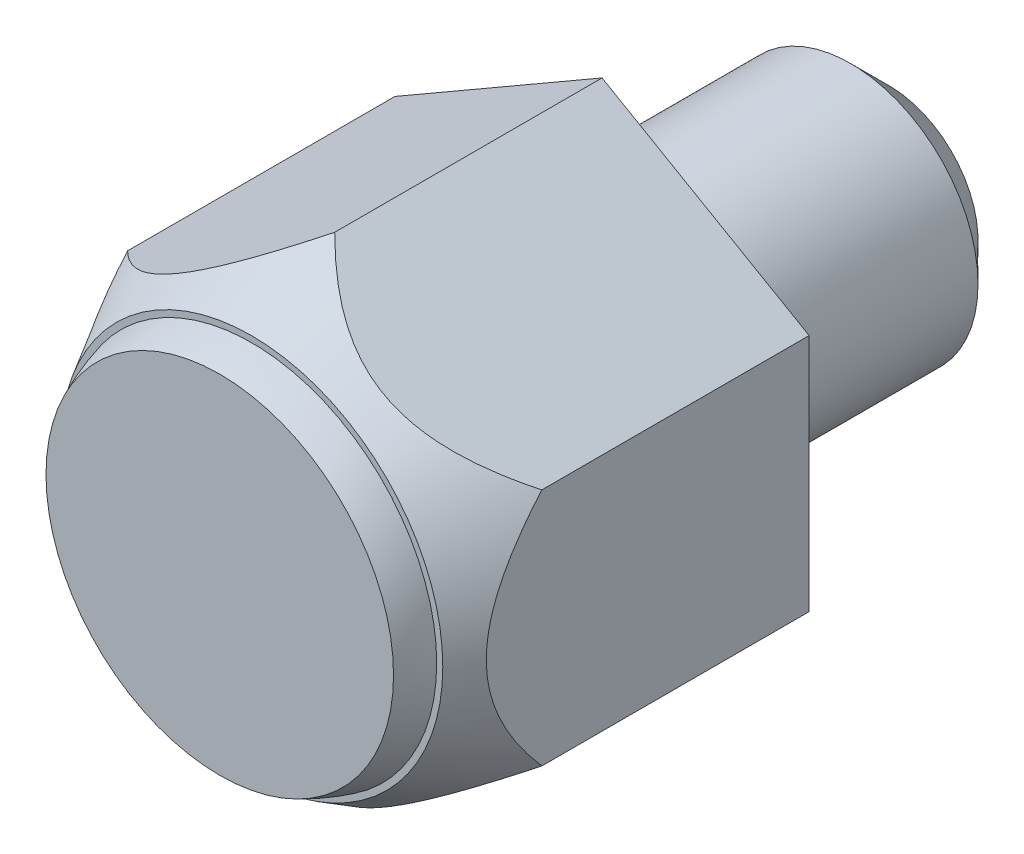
ISO-10303-21;
HEADER;
FILE_DESCRIPTION(('STEP AP214'),'2;1');
FILE_NAME('part.step','',(''),(''),'','','');
FILE_SCHEMA(('AUTOMOTIVE_DESIGN { 1 0 10303 214 1 1 1 1 }'));
ENDSEC;
DATA;
#1=APPLICATION_CONTEXT('core data for automotive mechanical design processes');
#2=APPLICATION_PROTOCOL_DEFINITION('international standard','automotive_design',2000,#1);
#3=PRODUCT_CONTEXT('',#1,'mechanical');
#4=PRODUCT('Part','Part','',(#3));
#5=PRODUCT_RELATED_PRODUCT_CATEGORY('part','',(#4));
#6=PRODUCT_DEFINITION_FORMATION('','',#4);
#7=PRODUCT_DEFINITION_CONTEXT('part definition',#1,'design');
#8=PRODUCT_DEFINITION('design','',#6,#7);
#9=PRODUCT_DEFINITION_SHAPE('','',#8);
#10=(LENGTH_UNIT() NAMED_UNIT(*) SI_UNIT(.MILLI.,.METRE.));
#11=(NAMED_UNIT(*) PLANE_ANGLE_UNIT() SI_UNIT($,.RADIAN.));
#12=(NAMED_UNIT(*) SI_UNIT($,.STERADIAN.) SOLID_ANGLE_UNIT());
#13=UNCERTAINTY_MEASURE_WITH_UNIT(LENGTH_MEASURE(1.E-05),#10,'distance_accuracy_value','');
#14=(GEOMETRIC_REPRESENTATION_CONTEXT(3) GLOBAL_UNCERTAINTY_ASSIGNED_CONTEXT((#13)) GLOBAL_UNIT_ASSIGNED_CONTEXT((#10,
#11,#12)) REPRESENTATION_CONTEXT('',''));
#15=CARTESIAN_POINT('',(0.,0.,0.));
#16=DIRECTION('',(0.,0.,1.));
#17=DIRECTION('',(1.,0.,0.));
#18=AXIS2_PLACEMENT_3D('',#15,#16,#17);
#19=CARTESIAN_POINT('',(0.,0.,12.));
#20=DIRECTION('',(0.,0.,1.));
#21=DIRECTION('',(1.,0.,0.));
#22=AXIS2_PLACEMENT_3D('',#19,#20,#21);
#23=PLANE('',#22);
#24=CARTESIAN_POINT('',(0.,0.,12.));
#25=DIRECTION('',(0.,0.,1.));
#26=DIRECTION('',(1.,0.,0.));
#27=AXIS2_PLACEMENT_3D('',#24,#25,#26);
#28=CIRCLE('',#27,5.45435605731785);
#29=CARTESIAN_POINT('',(5.45435605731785,0.,12.));
#30=VERTEX_POINT('',#29);
#31=EDGE_CURVE('E112',#30,#30,#28,.T.);
#32=ORIENTED_EDGE('',*,*,#31,.T.);
#33=EDGE_LOOP('',(#32));
#34=FACE_BOUND('',#33,.T.);
#35=ADVANCED_FACE('F14',(#34),#23,.T.);
#36=CARTESIAN_POINT('',(0.,0.,9.5));
#37=DIRECTION('',(0.,0.,1.));
#38=DIRECTION('',(1.,0.,0.));
#39=AXIS2_PLACEMENT_3D('',#36,#37,#38);
#40=SPHERICAL_SURFACE('',#39,6.);
#41=CARTESIAN_POINT('',(0.,0.,11.));
#42=DIRECTION('',(0.,0.,1.));
#43=DIRECTION('',(1.,0.,0.));
#44=AXIS2_PLACEMENT_3D('',#41,#42,#43);
#45=CIRCLE('',#44,5.80947501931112);
#46=CARTESIAN_POINT('',(5.80947501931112,0.,11.));
#47=VERTEX_POINT('',#46);
#48=EDGE_CURVE('E109',#47,#47,#45,.T.);
#49=CARTESIAN_POINT('',(5.80947501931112,0.,11.));
#50=CARTESIAN_POINT('',(5.8067079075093,0.,11.010716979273));
#51=CARTESIAN_POINT('',(5.80391113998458,0.,11.021426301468));
#52=CARTESIAN_POINT('',(5.79825838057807,0.,11.0428293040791));
#53=CARTESIAN_POINT('',(5.79540238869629,0.,11.0535229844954));
#54=CARTESIAN_POINT('',(5.78963126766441,0.,11.0748943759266));
#55=CARTESIAN_POINT('',(5.78671613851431,0.,11.0855720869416));
#56=CARTESIAN_POINT('',(5.78082683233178,0.,11.1069112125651));
#57=CARTESIAN_POINT('',(5.77785265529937,0.,11.1175726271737));
#58=CARTESIAN_POINT('',(5.77184534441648,0.,11.1388788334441));
#59=CARTESIAN_POINT('',(5.76881221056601,0.,11.1495236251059));
#60=CARTESIAN_POINT('',(5.76268707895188,0.,11.1707962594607));
#61=CARTESIAN_POINT('',(5.75959508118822,0.,11.1814241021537));
#62=CARTESIAN_POINT('',(5.75335231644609,0.,11.2026625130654));
#63=CARTESIAN_POINT('',(5.75020154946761,0.,11.2132730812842));
#64=CARTESIAN_POINT('',(5.74384134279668,0.,11.2344766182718));
#65=CARTESIAN_POINT('',(5.74063190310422,0.,11.2450695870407));
#66=CARTESIAN_POINT('',(5.73415444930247,0.,11.2662376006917));
#67=CARTESIAN_POINT('',(5.7308864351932,0.,11.2768126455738));
#68=CARTESIAN_POINT('',(5.72429193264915,0.,11.2979444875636));
#69=CARTESIAN_POINT('',(5.72096544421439,0.,11.3085012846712));
#70=CARTESIAN_POINT('',(5.71425409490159,0.,11.3295963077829));
#71=CARTESIAN_POINT('',(5.71086923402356,0.,11.340134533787));
#72=CARTESIAN_POINT('',(5.70404124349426,0.,11.3611920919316));
#73=CARTESIAN_POINT('',(5.70059811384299,0.,11.3717114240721));
#74=CARTESIAN_POINT('',(5.69365369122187,0.,11.392730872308));
#75=CARTESIAN_POINT('',(5.69015239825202,0.,11.4032309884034));
#76=CARTESIAN_POINT('',(5.68309175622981,0.,11.4242116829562));
#77=CARTESIAN_POINT('',(5.67953240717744,0.,11.4346922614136));
#78=CARTESIAN_POINT('',(5.67235576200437,0.,11.4556335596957));
#79=CARTESIAN_POINT('',(5.66873846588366,0.,11.4660942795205));
#80=CARTESIAN_POINT('',(5.66144603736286,0.,11.4869955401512));
#81=CARTESIAN_POINT('',(5.65777090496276,0.,11.4974360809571));
#82=CARTESIAN_POINT('',(5.65036291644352,0.,11.5182966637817));
#83=CARTESIAN_POINT('',(5.64663006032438,0.,11.5287167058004));
#84=CARTESIAN_POINT('',(5.63910673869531,0.,11.5495359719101));
#85=CARTESIAN_POINT('',(5.63531627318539,0.,11.5599351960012));
#86=CARTESIAN_POINT('',(5.62767784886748,0.,11.5807125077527));
#87=CARTESIAN_POINT('',(5.6238298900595,0.,11.5910905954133));
#88=CARTESIAN_POINT('',(5.61607659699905,0.,11.6118253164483));
#89=CARTESIAN_POINT('',(5.61217126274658,0.,11.6221819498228));
#90=CARTESIAN_POINT('',(5.60430333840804,0.,11.6428734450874));
#91=CARTESIAN_POINT('',(5.60034074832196,0.,11.6532083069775));
#92=CARTESIAN_POINT('',(5.59235843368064,0.,11.6738559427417));
#93=CARTESIAN_POINT('',(5.58833870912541,0.,11.6841687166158));
#94=CARTESIAN_POINT('',(5.58024224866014,0.,11.7047718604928));
#95=CARTESIAN_POINT('',(5.57616551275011,0.,11.7150622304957));
#96=CARTESIAN_POINT('',(5.56795515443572,0.,11.7356202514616));
#97=CARTESIAN_POINT('',(5.56382153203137,0.,11.7458879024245));
#98=CARTESIAN_POINT('',(5.55549752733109,0.,11.7664001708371));
#99=CARTESIAN_POINT('',(5.55130714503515,0.,11.7766447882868));
#100=CARTESIAN_POINT('',(5.54286974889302,0.,11.7971106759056));
#101=CARTESIAN_POINT('',(5.53862273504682,0.,11.8073319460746));
#102=CARTESIAN_POINT('',(5.53007220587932,0.,11.8277508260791));
#103=CARTESIAN_POINT('',(5.52576869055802,0.,11.8379484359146));
#104=CARTESIAN_POINT('',(5.51710529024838,0.,11.858319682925));
#105=CARTESIAN_POINT('',(5.51274540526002,0.,11.8684933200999));
#106=CARTESIAN_POINT('',(5.50396939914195,0.,11.8888163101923));
#107=CARTESIAN_POINT('',(5.49955327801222,0.,11.8989656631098));
#108=CARTESIAN_POINT('',(5.49066493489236,0.,11.9192397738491));
#109=CARTESIAN_POINT('',(5.48619271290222,0.,11.929364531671));
#110=CARTESIAN_POINT('',(5.47719230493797,0.,11.9495891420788));
#111=CARTESIAN_POINT('',(5.47266411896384,0.,11.9596889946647));
#112=CARTESIAN_POINT('',(5.46355192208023,0.,11.97986348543));
#113=CARTESIAN_POINT('',(5.45896791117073,0.,11.9899381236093));
#114=CARTESIAN_POINT('',(5.45435605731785,0.,12.));
#115=B_SPLINE_CURVE_WITH_KNOTS('',3,(#49,#50,#51,#52,#53,#54,#55,#56,#57,#58,#59,#60,#61,#62,
#63,#64,#65,#66,#67,#68,#69,#70,#71,#72,#73,#74,#75,#76,#77,#78,#79,#80,#81,#82,#83,#84,#85,#86,
#87,#88,#89,#90,#91,#92,#93,#94,#95,#96,#97,#98,#99,#100,#101,#102,#103,#104,#105,#106,#107,
#108,#109,#110,#111,#112,#113,#114),.UNSPECIFIED.,.F.,.F.,(4,2,2,2,2,2,2,2,2,2,2,2,2,2,2,2,2,2,
2,2,2,2,2,2,2,2,2,2,2,2,2,2,4),(0.,0.0332053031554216,0.0664106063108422,0.0996159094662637,
0.132821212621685,0.166026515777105,0.199231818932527,0.232437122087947,0.265642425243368,
0.29884772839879,0.332053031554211,0.365258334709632,0.398463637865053,0.431668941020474,
0.464874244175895,0.498079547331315,0.531284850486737,0.564490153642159,0.597695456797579,
0.630900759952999,0.664106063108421,0.697311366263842,0.730516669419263,0.763721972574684,
0.796927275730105,0.830132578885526,0.863337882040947,0.896543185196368,0.92974848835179,
0.96295379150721,0.996159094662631,1.02936439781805,1.06256970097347),.UNSPECIFIED.);
#116=EDGE_CURVE('BSEAM183',#47,#30,#115,.T.);
#117=ORIENTED_EDGE('',*,*,#48,.T.);
#118=ORIENTED_EDGE('',*,*,#31,.F.);
#119=ORIENTED_EDGE('',*,*,#116,.T.);
#120=ORIENTED_EDGE('',*,*,#116,.F.);
#121=EDGE_LOOP('',(#117,#119,#118,#120));
#122=FACE_BOUND('',#121,.T.);
#123=ADVANCED_FACE('F183',(#122),#40,.T.);
#124=CARTESIAN_POINT('',(5.80947501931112,0.,11.));
#125=DIRECTION('',(0.,0.,1.));
#126=DIRECTION('',(1.,0.,0.));
#127=AXIS2_PLACEMENT_3D('',#124,#125,#126);
#128=PLANE('',#127);
#129=CARTESIAN_POINT('',(0.,0.,11.));
#130=DIRECTION('',(0.,0.,1.));
#131=DIRECTION('',(1.,0.,0.));
#132=AXIS2_PLACEMENT_3D('',#129,#130,#131);
#133=CIRCLE('',#132,6.);
#134=CARTESIAN_POINT('',(6.,0.,11.));
#135=VERTEX_POINT('',#134);
#136=EDGE_CURVE('E79',#135,#135,#133,.T.);
#137=ORIENTED_EDGE('',*,*,#136,.T.);
#138=EDGE_LOOP('',(#137));
#139=FACE_BOUND('',#138,.T.);
#140=ORIENTED_EDGE('',*,*,#48,.F.);
#141=EDGE_LOOP('',(#140));
#142=FACE_BOUND('',#141,.T.);
#143=ADVANCED_FACE('F142',(#139,#142),#128,.T.);
#144=CARTESIAN_POINT('',(0.,0.,11.));
#145=DIRECTION('',(0.,0.,-1.));
#146=DIRECTION('',(-1.,0.,0.));
#147=AXIS2_PLACEMENT_3D('',#144,#145,#146);
#148=CONICAL_SURFACE('',#147,6.,0.523598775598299);
#149=CARTESIAN_POINT('',(0.000200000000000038,-7.505668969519,8.39210484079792));
#150=CARTESIAN_POINT('',(-0.0677848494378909,-7.4664178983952,8.4600858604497));
#151=CARTESIAN_POINT('',(-0.136448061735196,-7.42677517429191,8.52716017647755));
#152=CARTESIAN_POINT('',(-0.275280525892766,-7.34662021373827,8.65924264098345));
#153=CARTESIAN_POINT('',(-0.345450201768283,-7.3061077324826,8.72425019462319));
#154=CARTESIAN_POINT('',(-0.559107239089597,-7.18275278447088,8.91638593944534));
#155=CARTESIAN_POINT('',(-0.705052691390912,-7.09849113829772,9.03992894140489));
#156=CARTESIAN_POINT('',(-1.00830495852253,-6.9234083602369,9.2774020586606));
#157=CARTESIAN_POINT('',(-1.16580788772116,-6.83247400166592,9.39100134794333));
#158=CARTESIAN_POINT('',(-1.48934600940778,-6.64567918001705,9.60009315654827));
#159=CARTESIAN_POINT('',(-1.65536127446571,-6.54983022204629,9.69562571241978));
#160=CARTESIAN_POINT('',(-1.9184841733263,-6.39791614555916,9.82470210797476));
#161=CARTESIAN_POINT('',(-2.01251169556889,-6.34362933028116,9.8666537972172));
#162=CARTESIAN_POINT('',(-2.20302936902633,-6.23363390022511,9.9424252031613));
#163=CARTESIAN_POINT('',(-2.29951970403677,-6.17792517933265,9.97624431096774));
#164=CARTESIAN_POINT('',(-2.4938115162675,-6.06575074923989,10.0344577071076));
#165=CARTESIAN_POINT('',(-2.59159656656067,-6.00929452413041,10.0589244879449));
#166=CARTESIAN_POINT('',(-2.7886382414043,-5.89553246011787,10.0979257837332));
#167=CARTESIAN_POINT('',(-2.88789458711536,-5.83822678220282,10.1124621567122));
#168=CARTESIAN_POINT('',(-3.0880691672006,-5.72265593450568,10.1311082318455));
#169=CARTESIAN_POINT('',(-3.18899428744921,-5.66438678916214,10.135120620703));
#170=CARTESIAN_POINT('',(-3.39072664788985,-5.54791655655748,10.1322640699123));
#171=CARTESIAN_POINT('',(-3.49153388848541,-5.48971546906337,10.1253951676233));
#172=CARTESIAN_POINT('',(-3.69239484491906,-5.37374834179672,10.1010445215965));
#173=CARTESIAN_POINT('',(-3.79244644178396,-5.31598352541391,10.0835396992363));
#174=CARTESIAN_POINT('',(-3.99090038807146,-5.20140608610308,10.0385918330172));
#175=CARTESIAN_POINT('',(-4.08930170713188,-5.14459405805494,10.0111428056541));
#176=CARTESIAN_POINT('',(-4.3119645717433,-5.01603959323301,9.93805151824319));
#177=CARTESIAN_POINT('',(-4.43549595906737,-4.94471871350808,9.88944510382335));
#178=CARTESIAN_POINT('',(-4.67830004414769,-4.80453570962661,9.77963478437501));
#179=CARTESIAN_POINT('',(-4.79757006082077,-4.73567513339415,9.71842310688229));
#180=CARTESIAN_POINT('',(-5.03214160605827,-4.60024518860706,9.58538765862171));
#181=CARTESIAN_POINT('',(-5.147425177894,-4.53368618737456,9.51352206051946));
#182=CARTESIAN_POINT('',(-5.37365566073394,-4.40307195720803,9.36133304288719));
#183=CARTESIAN_POINT('',(-5.48460328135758,-4.33901631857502,9.28101101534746));
#184=CARTESIAN_POINT('',(-5.75326201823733,-4.18390612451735,9.07450545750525));
#185=CARTESIAN_POINT('',(-5.90869904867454,-4.09416451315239,8.94437902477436));
#186=CARTESIAN_POINT('',(-6.13543606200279,-3.96325783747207,8.74180970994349));
#187=CARTESIAN_POINT('',(-6.20954407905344,-3.92047155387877,8.67346346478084));
#188=CARTESIAN_POINT('',(-6.35608489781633,-3.83586617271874,8.53444941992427));
#189=CARTESIAN_POINT('',(-6.42851804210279,-3.7940468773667,8.46378210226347));
#190=CARTESIAN_POINT('',(-6.5002,-3.75266127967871,8.39210484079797));
#191=B_SPLINE_CURVE_WITH_KNOTS('',3,(#149,#150,#151,#152,#153,#154,#155,#156,#157,#158,#159,
#160,#161,#162,#163,#164,#165,#166,#167,#168,#169,#170,#171,#172,#173,#174,#175,#176,#177,#178,
#179,#180,#181,#182,#183,#184,#185,#186,#187,#188,#189,#190),.UNSPECIFIED.,.F.,.F.,(4,2,2,2,2,2,
2,2,2,2,2,2,2,2,2,2,2,2,2,2,4),(0.,0.311524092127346,0.62313704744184,1.24953684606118,
1.89212041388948,2.53326286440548,2.8821886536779,3.23114055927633,3.57732997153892,
3.92345459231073,4.27276865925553,4.62208152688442,4.97215508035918,5.3224396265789,
5.77378885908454,6.2254172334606,6.67886811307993,7.13224446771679,7.79667734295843,
8.12519954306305,8.45365394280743),.UNSPECIFIED.);
#192=CARTESIAN_POINT('',(0.,-7.50555349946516,8.39230484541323));
#193=VERTEX_POINT('',#192);
#194=CARTESIAN_POINT('',(-6.5,-3.75277674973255,8.39230484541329));
#195=VERTEX_POINT('',#194);
#196=EDGE_CURVE('E170',#193,#195,#191,.T.);
#197=ORIENTED_EDGE('',*,*,#196,.F.);
#198=CARTESIAN_POINT('',(-0.000199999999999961,-7.505668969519,8.39210484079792));
#199=CARTESIAN_POINT('',(0.0677848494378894,-7.46641789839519,8.4600858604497));
#200=CARTESIAN_POINT('',(0.136448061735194,-7.42677517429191,8.52716017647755));
#201=CARTESIAN_POINT('',(0.275280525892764,-7.34662021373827,8.65924264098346));
#202=CARTESIAN_POINT('',(0.345450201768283,-7.30610773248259,8.7242501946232));
#203=CARTESIAN_POINT('',(0.5591072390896,-7.18275278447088,8.91638593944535));
#204=CARTESIAN_POINT('',(0.705052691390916,-7.09849113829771,9.0399289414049));
#205=CARTESIAN_POINT('',(1.00830495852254,-6.9234083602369,9.27740205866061));
#206=CARTESIAN_POINT('',(1.16580788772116,-6.83247400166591,9.39100134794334));
#207=CARTESIAN_POINT('',(1.48934600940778,-6.64567918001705,9.60009315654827));
#208=CARTESIAN_POINT('',(1.65536127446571,-6.54983022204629,9.69562571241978));
#209=CARTESIAN_POINT('',(1.9184841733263,-6.39791614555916,9.82470210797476));
#210=CARTESIAN_POINT('',(2.01251169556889,-6.34362933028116,9.8666537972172));
#211=CARTESIAN_POINT('',(2.20302936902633,-6.23363390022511,9.94242520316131));
#212=CARTESIAN_POINT('',(2.29951970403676,-6.17792517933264,9.97624431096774));
#213=CARTESIAN_POINT('',(2.49381151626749,-6.06575074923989,10.0344577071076));
#214=CARTESIAN_POINT('',(2.59159656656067,-6.0092945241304,10.0589244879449));
#215=CARTESIAN_POINT('',(2.7886382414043,-5.89553246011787,10.0979257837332));
#216=CARTESIAN_POINT('',(2.88789458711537,-5.83822678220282,10.1124621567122));
#217=CARTESIAN_POINT('',(3.08806916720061,-5.72265593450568,10.1311082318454));
#218=CARTESIAN_POINT('',(3.18899428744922,-5.66438678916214,10.135120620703));
#219=CARTESIAN_POINT('',(3.39072664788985,-5.54791655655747,10.1322640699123));
#220=CARTESIAN_POINT('',(3.49153388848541,-5.48971546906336,10.1253951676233));
#221=CARTESIAN_POINT('',(3.69239484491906,-5.37374834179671,10.1010445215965));
#222=CARTESIAN_POINT('',(3.79244644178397,-5.3159835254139,10.0835396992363));
#223=CARTESIAN_POINT('',(3.99090038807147,-5.20140608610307,10.0385918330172));
#224=CARTESIAN_POINT('',(4.08930170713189,-5.14459405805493,10.0111428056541));
#225=CARTESIAN_POINT('',(4.3119645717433,-5.016039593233,9.93805151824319));
#226=CARTESIAN_POINT('',(4.43549595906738,-4.94471871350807,9.88944510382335));
#227=CARTESIAN_POINT('',(4.6783000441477,-4.8045357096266,9.77963478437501));
#228=CARTESIAN_POINT('',(4.79757006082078,-4.73567513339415,9.71842310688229));
#229=CARTESIAN_POINT('',(5.03214160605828,-4.60024518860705,9.58538765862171));
#230=CARTESIAN_POINT('',(5.147425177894,-4.53368618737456,9.51352206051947));
#231=CARTESIAN_POINT('',(5.37365566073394,-4.40307195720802,9.36133304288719));
#232=CARTESIAN_POINT('',(5.48460328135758,-4.33901631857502,9.28101101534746));
#233=CARTESIAN_POINT('',(5.75326201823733,-4.18390612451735,9.07450545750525));
#234=CARTESIAN_POINT('',(5.90869904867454,-4.09416451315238,8.94437902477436));
#235=CARTESIAN_POINT('',(6.13543606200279,-3.96325783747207,8.7418097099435));
#236=CARTESIAN_POINT('',(6.20954407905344,-3.92047155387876,8.67346346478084));
#237=CARTESIAN_POINT('',(6.35608489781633,-3.83586617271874,8.53444941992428));
#238=CARTESIAN_POINT('',(6.42851804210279,-3.7940468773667,8.46378210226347));
#239=CARTESIAN_POINT('',(6.5002,-3.75266127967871,8.39210484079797));
#240=B_SPLINE_CURVE_WITH_KNOTS('',3,(#198,#199,#200,#201,#202,#203,#204,#205,#206,#207,#208,
#209,#210,#211,#212,#213,#214,#215,#216,#217,#218,#219,#220,#221,#222,#223,#224,#225,#226,#227,
#228,#229,#230,#231,#232,#233,#234,#235,#236,#237,#238,#239),.UNSPECIFIED.,.F.,.F.,(4,2,2,2,2,2,
2,2,2,2,2,2,2,2,2,2,2,2,2,2,4),(0.,0.31152409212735,0.623137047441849,1.24953684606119,
1.89212041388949,2.53326286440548,2.8821886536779,3.23114055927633,3.57732997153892,
3.92345459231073,4.27276865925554,4.62208152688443,4.97215508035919,5.32243962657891,
5.77378885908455,6.22541723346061,6.67886811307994,7.1322444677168,7.79667734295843,
8.12519954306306,8.45365394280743),.UNSPECIFIED.);
#241=CARTESIAN_POINT('',(6.5,-3.75277674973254,8.39230484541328));
#242=VERTEX_POINT('',#241);
#243=EDGE_CURVE('E76',#193,#242,#240,.T.);
#244=ORIENTED_EDGE('',*,*,#243,.T.);
#245=CARTESIAN_POINT('',(6.5,-9.62244936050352,1.279508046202));
#246=CARTESIAN_POINT('',(6.5,-9.41415140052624,1.5784115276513));
#247=CARTESIAN_POINT('',(6.5,-9.20447714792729,1.87636656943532));
#248=CARTESIAN_POINT('',(6.5,-8.78167793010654,2.46991169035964));
#249=CARTESIAN_POINT('',(6.5,-8.56855224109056,2.76550125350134));
#250=CARTESIAN_POINT('',(6.5,-8.13622635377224,3.35647240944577));
#251=CARTESIAN_POINT('',(6.5,-7.9169879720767,3.65182616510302));
#252=CARTESIAN_POINT('',(6.5,-7.58434970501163,4.09196487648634));
#253=CARTESIAN_POINT('',(6.5,-7.47284827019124,4.23818544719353));
#254=CARTESIAN_POINT('',(6.5,-7.24842551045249,4.52955041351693));
#255=CARTESIAN_POINT('',(6.5,-7.13550407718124,4.67469472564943));
#256=CARTESIAN_POINT('',(6.5,-6.76928529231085,5.14019384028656));
#257=CARTESIAN_POINT('',(6.5,-6.51290448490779,5.45813640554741));
#258=CARTESIAN_POINT('',(6.5,-5.9902026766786,6.08574560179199));
#259=CARTESIAN_POINT('',(6.5,-5.72388307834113,6.39541338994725));
#260=CARTESIAN_POINT('',(6.5,-5.31502547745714,6.85042692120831));
#261=CARTESIAN_POINT('',(6.5,-5.17745323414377,7.00023449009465));
#262=CARTESIAN_POINT('',(6.5,-4.89848794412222,7.29624132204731));
#263=CARTESIAN_POINT('',(6.5,-4.75709518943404,7.4424408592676));
#264=CARTESIAN_POINT('',(6.5,-4.46995291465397,7.73030091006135));
#265=CARTESIAN_POINT('',(6.5,-4.32420659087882,7.87196460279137));
#266=CARTESIAN_POINT('',(6.5,-4.02751933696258,8.14972338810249));
#267=CARTESIAN_POINT('',(6.5,-3.87657948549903,8.28581962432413));
#268=CARTESIAN_POINT('',(6.5,-3.64222631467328,8.48754253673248));
#269=CARTESIAN_POINT('',(6.5,-3.56103251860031,8.55575018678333));
#270=CARTESIAN_POINT('',(6.5,-3.39683576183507,8.68995206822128));
#271=CARTESIAN_POINT('',(6.5,-3.31383276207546,8.75594625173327));
#272=CARTESIAN_POINT('',(6.5,-3.06178492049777,8.95021924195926));
#273=CARTESIAN_POINT('',(6.5,-2.88977734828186,9.07472214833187));
#274=CARTESIAN_POINT('',(6.5,-2.53893831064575,9.30880459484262));
#275=CARTESIAN_POINT('',(6.5,-2.36021998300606,9.4185522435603));
#276=CARTESIAN_POINT('',(6.5,-1.99310604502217,9.62044012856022));
#277=CARTESIAN_POINT('',(6.5,-1.80472118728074,9.71259941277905));
#278=CARTESIAN_POINT('',(6.5,-1.5047907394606,9.83760824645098));
#279=CARTESIAN_POINT('',(6.5,-1.39659887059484,9.87853988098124));
#280=CARTESIAN_POINT('',(6.5,-1.17745974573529,9.95226112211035));
#281=CARTESIAN_POINT('',(6.5,-1.06651286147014,9.98505182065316));
#282=CARTESIAN_POINT('',(6.5,-0.842426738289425,10.0414351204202));
#283=CARTESIAN_POINT('',(6.5,-0.729290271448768,10.0650386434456));
#284=CARTESIAN_POINT('',(6.5,-0.501388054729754,10.1022390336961));
#285=CARTESIAN_POINT('',(6.5,-0.386622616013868,10.1158377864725));
#286=CARTESIAN_POINT('',(6.5,-0.155587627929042,10.1325349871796));
#287=CARTESIAN_POINT('',(6.5,-0.0393131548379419,10.1355661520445));
#288=CARTESIAN_POINT('',(6.5,0.193008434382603,10.1308094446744));
#289=CARTESIAN_POINT('',(6.5,0.30905555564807,10.123021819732));
#290=CARTESIAN_POINT('',(6.5,0.540024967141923,10.0969515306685));
#291=CARTESIAN_POINT('',(6.5,0.654946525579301,10.0786624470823));
#292=CARTESIAN_POINT('',(6.5,0.882792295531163,10.0323078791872));
#293=CARTESIAN_POINT('',(6.5,0.995716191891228,10.004240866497));
#294=CARTESIAN_POINT('',(6.5,1.25285777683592,9.929440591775));
#295=CARTESIAN_POINT('',(6.5,1.39617941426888,9.87962778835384));
#296=CARTESIAN_POINT('',(6.5,1.67778549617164,9.76739817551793));
#297=CARTESIAN_POINT('',(6.5,1.81606770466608,9.70497584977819));
#298=CARTESIAN_POINT('',(6.5,2.08877262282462,9.56913982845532));
#299=CARTESIAN_POINT('',(6.5,2.22314409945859,9.49562422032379));
#300=CARTESIAN_POINT('',(6.5,2.48676457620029,9.34008739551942));
#301=CARTESIAN_POINT('',(6.5,2.61601512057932,9.25806877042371));
#302=CARTESIAN_POINT('',(6.5,2.92796510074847,9.04801037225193));
#303=CARTESIAN_POINT('',(6.5,3.10804522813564,8.91609154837));
#304=CARTESIAN_POINT('',(6.5,3.45977019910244,8.64137802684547));
#305=CARTESIAN_POINT('',(6.5,3.63140964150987,8.49857651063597));
#306=CARTESIAN_POINT('',(6.5,3.96811955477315,8.20426691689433));
#307=CARTESIAN_POINT('',(6.5,4.13316366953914,8.05272887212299));
#308=CARTESIAN_POINT('',(6.5,4.45713991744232,7.74336572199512));
#309=CARTESIAN_POINT('',(6.5,4.61607346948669,7.58554209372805));
#310=CARTESIAN_POINT('',(6.5,4.91948432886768,7.27451903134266));
#311=CARTESIAN_POINT('',(6.5,5.06425783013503,7.12160725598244));
#312=CARTESIAN_POINT('',(6.5,5.34996019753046,6.81221715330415));
#313=CARTESIAN_POINT('',(6.5,5.49088872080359,6.6557385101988));
#314=CARTESIAN_POINT('',(6.5,5.76821646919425,6.3412504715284));
#315=CARTESIAN_POINT('',(6.5,5.90464452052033,6.18326641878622));
#316=CARTESIAN_POINT('',(6.5,6.17463283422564,5.86493450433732));
#317=CARTESIAN_POINT('',(6.5,6.30819382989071,5.70458726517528));
#318=CARTESIAN_POINT('',(6.5,6.44054958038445,5.54326586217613));
#319=B_SPLINE_CURVE_WITH_KNOTS('',3,(#245,#246,#247,#248,#249,#250,#251,#252,#253,#254,#255,
#256,#257,#258,#259,#260,#261,#262,#263,#264,#265,#266,#267,#268,#269,#270,#271,#272,#273,#274,
#275,#276,#277,#278,#279,#280,#281,#282,#283,#284,#285,#286,#287,#288,#289,#290,#291,#292,#293,
#294,#295,#296,#297,#298,#299,#300,#301,#302,#303,#304,#305,#306,#307,#308,#309,#310,#311,#312,
#313,#314,#315,#316,#317,#318),.UNSPECIFIED.,.F.,.F.,(4,2,2,2,2,2,2,2,2,2,2,2,2,2,2,2,2,2,2,2,2,
2,2,2,2,2,2,2,2,2,2,2,2,2,2,2,4),(0.,1.09297794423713,2.18618814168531,3.28962965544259,
3.84127157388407,4.39295584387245,5.61811470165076,6.84310132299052,7.4532255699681,
8.06330331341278,8.67294365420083,9.28245813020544,9.60054638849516,9.91864152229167,
10.5551342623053,11.1836158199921,11.8114128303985,12.1581745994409,12.504889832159,
12.8511916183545,13.1974281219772,13.5458651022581,13.8942941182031,14.2429363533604,
14.5916331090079,15.0460847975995,15.5007357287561,15.959851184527,16.4188271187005,
17.0879206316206,17.757436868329,18.4294047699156,19.1012156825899,19.732861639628,
20.3645637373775,20.990743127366,21.6167604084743),.UNSPECIFIED.);
#320=CARTESIAN_POINT('',(6.5,3.75277674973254,8.39230484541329));
#321=VERTEX_POINT('',#320);
#322=EDGE_CURVE('E160',#321,#242,#319,.F.);
#323=ORIENTED_EDGE('',*,*,#322,.F.);
#324=CARTESIAN_POINT('',(-0.000199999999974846,7.50566896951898,8.39210484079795));
#325=CARTESIAN_POINT('',(0.0677848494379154,7.46641789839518,8.46008586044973));
#326=CARTESIAN_POINT('',(0.13644806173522,7.42677517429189,8.52716017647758));
#327=CARTESIAN_POINT('',(0.275280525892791,7.34662021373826,8.65924264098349));
#328=CARTESIAN_POINT('',(0.345450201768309,7.30610773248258,8.72425019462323));
#329=CARTESIAN_POINT('',(0.559107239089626,7.18275278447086,8.91638593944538));
#330=CARTESIAN_POINT('',(0.705052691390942,7.0984911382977,9.03992894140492));
#331=CARTESIAN_POINT('',(1.00830495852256,6.92340836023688,9.27740205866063));
#332=CARTESIAN_POINT('',(1.16580788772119,6.8324740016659,9.39100134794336));
#333=CARTESIAN_POINT('',(1.48934600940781,6.64567918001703,9.60009315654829));
#334=CARTESIAN_POINT('',(1.65536127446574,6.54983022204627,9.6956257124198));
#335=CARTESIAN_POINT('',(1.91848417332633,6.39791614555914,9.82470210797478));
#336=CARTESIAN_POINT('',(2.01251169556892,6.34362933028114,9.86665379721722));
#337=CARTESIAN_POINT('',(2.20302936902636,6.23363390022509,9.94242520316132));
#338=CARTESIAN_POINT('',(2.2995197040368,6.17792517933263,9.97624431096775));
#339=CARTESIAN_POINT('',(2.49381151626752,6.06575074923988,10.0344577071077));
#340=CARTESIAN_POINT('',(2.59159656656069,6.00929452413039,10.0589244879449));
#341=CARTESIAN_POINT('',(2.78863824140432,5.89553246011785,10.0979257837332));
#342=CARTESIAN_POINT('',(2.88789458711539,5.83822678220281,10.1124621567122));
#343=CARTESIAN_POINT('',(3.08806916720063,5.72265593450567,10.1311082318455));
#344=CARTESIAN_POINT('',(3.18899428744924,5.66438678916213,10.135120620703));
#345=CARTESIAN_POINT('',(3.39072664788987,5.54791655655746,10.1322640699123));
#346=CARTESIAN_POINT('',(3.49153388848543,5.48971546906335,10.1253951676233));
#347=CARTESIAN_POINT('',(3.69239484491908,5.3737483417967,10.1010445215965));
#348=CARTESIAN_POINT('',(3.79244644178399,5.31598352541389,10.0835396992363));
#349=CARTESIAN_POINT('',(3.99090038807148,5.20140608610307,10.0385918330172));
#350=CARTESIAN_POINT('',(4.0893017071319,5.14459405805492,10.0111428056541));
#351=CARTESIAN_POINT('',(4.31196457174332,5.01603959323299,9.93805151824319));
#352=CARTESIAN_POINT('',(4.4354959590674,4.94471871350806,9.88944510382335));
#353=CARTESIAN_POINT('',(4.67830004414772,4.80453570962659,9.77963478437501));
#354=CARTESIAN_POINT('',(4.7975700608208,4.73567513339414,9.71842310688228));
#355=CARTESIAN_POINT('',(5.0321416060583,4.60024518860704,9.5853876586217));
#356=CARTESIAN_POINT('',(5.14742517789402,4.53368618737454,9.51352206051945));
#357=CARTESIAN_POINT('',(5.37365566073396,4.40307195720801,9.36133304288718));
#358=CARTESIAN_POINT('',(5.4846032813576,4.339016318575,9.28101101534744));
#359=CARTESIAN_POINT('',(5.75326201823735,4.18390612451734,9.07450545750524));
#360=CARTESIAN_POINT('',(5.90869904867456,4.09416451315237,8.94437902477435));
#361=CARTESIAN_POINT('',(6.1354360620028,3.96325783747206,8.74180970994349));
#362=CARTESIAN_POINT('',(6.20954407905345,3.92047155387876,8.67346346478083));
#363=CARTESIAN_POINT('',(6.35608489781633,3.83586617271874,8.53444941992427));
#364=CARTESIAN_POINT('',(6.42851804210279,3.7940468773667,8.46378210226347));
#365=CARTESIAN_POINT('',(6.5002,3.75266127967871,8.39210484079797));
#366=B_SPLINE_CURVE_WITH_KNOTS('',3,(#324,#325,#326,#327,#328,#329,#330,#331,#332,#333,#334,
#335,#336,#337,#338,#339,#340,#341,#342,#343,#344,#345,#346,#347,#348,#349,#350,#351,#352,#353,
#354,#355,#356,#357,#358,#359,#360,#361,#362,#363,#364,#365),.UNSPECIFIED.,.F.,.F.,(4,2,2,2,2,2,
2,2,2,2,2,2,2,2,2,2,2,2,2,2,4),(0.,0.311524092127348,0.623137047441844,1.24953684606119,
1.89212041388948,2.53326286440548,2.88218865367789,3.23114055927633,3.57732997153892,
3.92345459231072,4.27276865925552,4.62208152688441,4.97215508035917,5.32243962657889,
5.77378885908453,6.2254172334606,6.67886811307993,7.1322444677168,7.79667734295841,
8.12519954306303,8.45365394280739),.UNSPECIFIED.);
#367=CARTESIAN_POINT('',(0.,7.50555349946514,8.39230484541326));
#368=VERTEX_POINT('',#367);
#369=EDGE_CURVE('E153',#368,#321,#366,.T.);
#370=ORIENTED_EDGE('',*,*,#369,.F.);
#371=CARTESIAN_POINT('',(0.000200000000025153,7.50566896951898,8.39210484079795));
#372=CARTESIAN_POINT('',(-0.0677848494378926,7.46641789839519,8.46008586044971));
#373=CARTESIAN_POINT('',(-0.136448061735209,7.42677517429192,8.52716017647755));
#374=CARTESIAN_POINT('',(-0.275280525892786,7.34662021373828,8.65924264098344));
#375=CARTESIAN_POINT('',(-0.345450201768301,7.3061077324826,8.72425019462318));
#376=CARTESIAN_POINT('',(-0.559107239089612,7.18275278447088,8.91638593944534));
#377=CARTESIAN_POINT('',(-0.705052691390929,7.09849113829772,9.03992894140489));
#378=CARTESIAN_POINT('',(-1.00830495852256,6.92340836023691,9.27740205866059));
#379=CARTESIAN_POINT('',(-1.1658078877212,6.83247400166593,9.39100134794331));
#380=CARTESIAN_POINT('',(-1.4893460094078,6.64567918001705,9.60009315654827));
#381=CARTESIAN_POINT('',(-1.65536127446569,6.54983022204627,9.69562571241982));
#382=CARTESIAN_POINT('',(-1.91848417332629,6.39791614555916,9.82470210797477));
#383=CARTESIAN_POINT('',(-2.0125116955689,6.34362933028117,9.86665379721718));
#384=CARTESIAN_POINT('',(-2.20302936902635,6.23363390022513,9.94242520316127));
#385=CARTESIAN_POINT('',(-2.29951970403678,6.17792517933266,9.97624431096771));
#386=CARTESIAN_POINT('',(-2.49381151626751,6.06575074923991,10.0344577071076));
#387=CARTESIAN_POINT('',(-2.59159656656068,6.00929452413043,10.0589244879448));
#388=CARTESIAN_POINT('',(-2.7886382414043,5.89553246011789,10.0979257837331));
#389=CARTESIAN_POINT('',(-2.88789458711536,5.83822678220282,10.1124621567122));
#390=CARTESIAN_POINT('',(-3.08806916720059,5.72265593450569,10.1311082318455));
#391=CARTESIAN_POINT('',(-3.1889942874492,5.66438678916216,10.135120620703));
#392=CARTESIAN_POINT('',(-3.39072664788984,5.54791655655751,10.1322640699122));
#393=CARTESIAN_POINT('',(-3.4915338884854,5.4897154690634,10.1253951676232));
#394=CARTESIAN_POINT('',(-3.69239484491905,5.37374834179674,10.1010445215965));
#395=CARTESIAN_POINT('',(-3.79244644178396,5.31598352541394,10.0835396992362));
#396=CARTESIAN_POINT('',(-3.99090038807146,5.20140608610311,10.0385918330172));
#397=CARTESIAN_POINT('',(-4.08930170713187,5.14459405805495,10.0111428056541));
#398=CARTESIAN_POINT('',(-4.31196457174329,5.01603959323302,9.93805151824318));
#399=CARTESIAN_POINT('',(-4.43549595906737,4.9447187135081,9.88944510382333));
#400=CARTESIAN_POINT('',(-4.67830004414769,4.80453570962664,9.77963478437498));
#401=CARTESIAN_POINT('',(-4.79757006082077,4.73567513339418,9.71842310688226));
#402=CARTESIAN_POINT('',(-5.03214160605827,4.60024518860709,9.58538765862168));
#403=CARTESIAN_POINT('',(-5.147425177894,4.53368618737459,9.51352206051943));
#404=CARTESIAN_POINT('',(-5.37365566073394,4.40307195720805,9.36133304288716));
#405=CARTESIAN_POINT('',(-5.48460328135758,4.33901631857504,9.28101101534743));
#406=CARTESIAN_POINT('',(-5.75326201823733,4.18390612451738,9.07450545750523));
#407=CARTESIAN_POINT('',(-5.90869904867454,4.09416451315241,8.94437902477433));
#408=CARTESIAN_POINT('',(-6.13543606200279,3.9632578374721,8.74180970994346));
#409=CARTESIAN_POINT('',(-6.20954407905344,3.9204715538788,8.67346346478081));
#410=CARTESIAN_POINT('',(-6.35608489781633,3.83586617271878,8.53444941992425));
#411=CARTESIAN_POINT('',(-6.42851804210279,3.79404687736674,8.46378210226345));
#412=CARTESIAN_POINT('',(-6.5002,3.75266127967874,8.39210484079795));
#413=B_SPLINE_CURVE_WITH_KNOTS('',3,(#371,#372,#373,#374,#375,#376,#377,#378,#379,#380,#381,
#382,#383,#384,#385,#386,#387,#388,#389,#390,#391,#392,#393,#394,#395,#396,#397,#398,#399,#400,
#401,#402,#403,#404,#405,#406,#407,#408,#409,#410,#411,#412),.UNSPECIFIED.,.F.,.F.,(4,2,2,2,2,2,
2,2,2,2,2,2,2,2,2,2,2,2,2,2,4),(0.,0.31152409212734,0.623137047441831,1.24953684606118,
1.89212041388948,2.53326286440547,2.88218865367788,3.23114055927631,3.5773299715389,
3.92345459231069,4.27276865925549,4.62208152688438,4.97215508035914,5.32243962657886,
5.7737888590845,6.22541723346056,6.6788681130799,7.13224446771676,7.7966773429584,
8.12519954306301,8.45365394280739),.UNSPECIFIED.);
#414=CARTESIAN_POINT('',(-6.5,3.75277674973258,8.39230484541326));
#415=VERTEX_POINT('',#414);
#416=EDGE_CURVE('E127',#368,#415,#413,.T.);
#417=ORIENTED_EDGE('',*,*,#416,.T.);
#418=CARTESIAN_POINT('',(-6.5,-9.62244936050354,1.27950804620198));
#419=CARTESIAN_POINT('',(-6.5,-9.41415140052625,1.57841152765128));
#420=CARTESIAN_POINT('',(-6.5,-9.2044771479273,1.8763665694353));
#421=CARTESIAN_POINT('',(-6.5,-8.78167793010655,2.46991169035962));
#422=CARTESIAN_POINT('',(-6.5,-8.56855224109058,2.76550125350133));
#423=CARTESIAN_POINT('',(-6.5,-8.13622635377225,3.35647240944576));
#424=CARTESIAN_POINT('',(-6.5,-7.91698797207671,3.65182616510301));
#425=CARTESIAN_POINT('',(-6.5,-7.58434970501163,4.09196487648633));
#426=CARTESIAN_POINT('',(-6.5,-7.47284827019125,4.23818544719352));
#427=CARTESIAN_POINT('',(-6.5,-7.2484255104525,4.52955041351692));
#428=CARTESIAN_POINT('',(-6.5,-7.13550407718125,4.67469472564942));
#429=CARTESIAN_POINT('',(-6.5,-6.76928529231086,5.14019384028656));
#430=CARTESIAN_POINT('',(-6.5,-6.51290448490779,5.45813640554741));
#431=CARTESIAN_POINT('',(-6.5,-5.9902026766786,6.08574560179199));
#432=CARTESIAN_POINT('',(-6.5,-5.72388307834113,6.39541338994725));
#433=CARTESIAN_POINT('',(-6.5,-5.31502547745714,6.85042692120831));
#434=CARTESIAN_POINT('',(-6.5,-5.17745323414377,7.00023449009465));
#435=CARTESIAN_POINT('',(-6.5,-4.89848794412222,7.29624132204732));
#436=CARTESIAN_POINT('',(-6.5,-4.75709518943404,7.4424408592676));
#437=CARTESIAN_POINT('',(-6.5,-4.46995291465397,7.73030091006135));
#438=CARTESIAN_POINT('',(-6.5,-4.32420659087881,7.87196460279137));
#439=CARTESIAN_POINT('',(-6.5,-4.02751933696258,8.14972338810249));
#440=CARTESIAN_POINT('',(-6.5,-3.87657948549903,8.28581962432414));
#441=CARTESIAN_POINT('',(-6.5,-3.64222631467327,8.48754253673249));
#442=CARTESIAN_POINT('',(-6.5,-3.56103251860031,8.55575018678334));
#443=CARTESIAN_POINT('',(-6.5,-3.39683576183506,8.68995206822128));
#444=CARTESIAN_POINT('',(-6.5,-3.31383276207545,8.75594625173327));
#445=CARTESIAN_POINT('',(-6.5,-3.06178492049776,8.95021924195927));
#446=CARTESIAN_POINT('',(-6.5,-2.88977734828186,9.07472214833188));
#447=CARTESIAN_POINT('',(-6.5,-2.53893831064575,9.30880459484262));
#448=CARTESIAN_POINT('',(-6.5,-2.36021998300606,9.41855224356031));
#449=CARTESIAN_POINT('',(-6.5,-1.99310604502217,9.62044012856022));
#450=CARTESIAN_POINT('',(-6.5,-1.80472118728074,9.71259941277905));
#451=CARTESIAN_POINT('',(-6.5,-1.5047907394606,9.83760824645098));
#452=CARTESIAN_POINT('',(-6.5,-1.39659887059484,9.87853988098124));
#453=CARTESIAN_POINT('',(-6.5,-1.17745974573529,9.95226112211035));
#454=CARTESIAN_POINT('',(-6.5,-1.06651286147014,9.98505182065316));
#455=CARTESIAN_POINT('',(-6.5,-0.842426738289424,10.0414351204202));
#456=CARTESIAN_POINT('',(-6.5,-0.729290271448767,10.0650386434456));
#457=CARTESIAN_POINT('',(-6.5,-0.501388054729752,10.1022390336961));
#458=CARTESIAN_POINT('',(-6.5,-0.386622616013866,10.1158377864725));
#459=CARTESIAN_POINT('',(-6.5,-0.155587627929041,10.1325349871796));
#460=CARTESIAN_POINT('',(-6.5,-0.0393131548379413,10.1355661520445));
#461=CARTESIAN_POINT('',(-6.5,0.193008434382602,10.1308094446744));
#462=CARTESIAN_POINT('',(-6.5,0.309055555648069,10.123021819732));
#463=CARTESIAN_POINT('',(-6.5,0.540024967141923,10.0969515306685));
#464=CARTESIAN_POINT('',(-6.5,0.654946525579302,10.0786624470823));
#465=CARTESIAN_POINT('',(-6.5,0.882792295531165,10.0323078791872));
#466=CARTESIAN_POINT('',(-6.5,0.99571619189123,10.0042408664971));
#467=CARTESIAN_POINT('',(-6.5,1.25285777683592,9.929440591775));
#468=CARTESIAN_POINT('',(-6.5,1.39617941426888,9.87962778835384));
#469=CARTESIAN_POINT('',(-6.5,1.67778549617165,9.76739817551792));
#470=CARTESIAN_POINT('',(-6.5,1.81606770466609,9.70497584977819));
#471=CARTESIAN_POINT('',(-6.5,2.08877262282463,9.56913982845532));
#472=CARTESIAN_POINT('',(-6.5,2.2231440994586,9.49562422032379));
#473=CARTESIAN_POINT('',(-6.5,2.4867645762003,9.34008739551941));
#474=CARTESIAN_POINT('',(-6.5,2.61601512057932,9.25806877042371));
#475=CARTESIAN_POINT('',(-6.5,2.92796510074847,9.04801037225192));
#476=CARTESIAN_POINT('',(-6.5,3.10804522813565,8.91609154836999));
#477=CARTESIAN_POINT('',(-6.5,3.45977019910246,8.64137802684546));
#478=CARTESIAN_POINT('',(-6.5,3.63140964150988,8.49857651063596));
#479=CARTESIAN_POINT('',(-6.5,3.96811955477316,8.20426691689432));
#480=CARTESIAN_POINT('',(-6.5,4.13316366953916,8.05272887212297));
#481=CARTESIAN_POINT('',(-6.5,4.45713991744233,7.7433657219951));
#482=CARTESIAN_POINT('',(-6.5,4.6160734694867,7.58554209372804));
#483=CARTESIAN_POINT('',(-6.5,4.9194843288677,7.27451903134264));
#484=CARTESIAN_POINT('',(-6.5,5.06425783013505,7.12160725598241));
#485=CARTESIAN_POINT('',(-6.5,5.34996019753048,6.81221715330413));
#486=CARTESIAN_POINT('',(-6.5,5.49088872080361,6.65573851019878));
#487=CARTESIAN_POINT('',(-6.5,5.76821646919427,6.34125047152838));
#488=CARTESIAN_POINT('',(-6.5,5.90464452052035,6.1832664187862));
#489=CARTESIAN_POINT('',(-6.5,6.17463283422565,5.8649345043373));
#490=CARTESIAN_POINT('',(-6.5,6.30819382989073,5.70458726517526));
#491=CARTESIAN_POINT('',(-6.5,6.44054958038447,5.54326586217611));
#492=B_SPLINE_CURVE_WITH_KNOTS('',3,(#418,#419,#420,#421,#422,#423,#424,#425,#426,#427,#428,
#429,#430,#431,#432,#433,#434,#435,#436,#437,#438,#439,#440,#441,#442,#443,#444,#445,#446,#447,
#448,#449,#450,#451,#452,#453,#454,#455,#456,#457,#458,#459,#460,#461,#462,#463,#464,#465,#466,
#467,#468,#469,#470,#471,#472,#473,#474,#475,#476,#477,#478,#479,#480,#481,#482,#483,#484,#485,
#486,#487,#488,#489,#490,#491),.UNSPECIFIED.,.F.,.F.,(4,2,2,2,2,2,2,2,2,2,2,2,2,2,2,2,2,2,2,2,2,
2,2,2,2,2,2,2,2,2,2,2,2,2,2,2,4),(0.,1.09297794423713,2.18618814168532,3.2896296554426,
3.84127157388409,4.39295584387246,5.61811470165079,6.84310132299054,7.45322556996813,
8.06330331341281,8.67294365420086,9.28245813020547,9.60054638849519,9.9186415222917,
10.5551342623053,11.1836158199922,11.8114128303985,12.1581745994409,12.5048898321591,
12.8511916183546,13.1974281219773,13.5458651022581,13.8942941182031,14.2429363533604,
14.591633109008,15.0460847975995,15.5007357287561,15.959851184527,16.4188271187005,
17.0879206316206,17.7574368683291,18.4294047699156,19.10121568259,19.7328616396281,
20.3645637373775,20.990743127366,21.6167604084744),.UNSPECIFIED.);
#493=EDGE_CURVE('E118',#415,#195,#492,.F.);
#494=ORIENTED_EDGE('',*,*,#493,.T.);
#495=EDGE_LOOP('',(#197,#244,#323,#370,#417,#494));
#496=FACE_BOUND('',#495,.T.);
#497=ORIENTED_EDGE('',*,*,#136,.F.);
#498=EDGE_LOOP('',(#497));
#499=FACE_BOUND('',#498,.T.);
#500=ADVANCED_FACE('F137',(#496,#499),#148,.T.);
#501=CARTESIAN_POINT('',(-6.5,-3.75277674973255,15.));
#502=DIRECTION('',(0.5,0.866025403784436,0.));
#503=DIRECTION('',(-0.866025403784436,0.5,0.));
#504=AXIS2_PLACEMENT_3D('',#501,#502,#503);
#505=PLANE('',#504);
#506=ORIENTED_EDGE('',*,*,#196,.T.);
#507=DIRECTION('',(0.,0.,-1.));
#508=VECTOR('',#507,1.);
#509=CARTESIAN_POINT('',(-6.5,-3.75277674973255,15.));
#510=LINE('',#509,#508);
#511=CARTESIAN_POINT('',(-6.5,-3.75277674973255,0.));
#512=VERTEX_POINT('',#511);
#513=EDGE_CURVE('E37',#195,#512,#510,.T.);
#514=ORIENTED_EDGE('',*,*,#513,.T.);
#515=DIRECTION('',(0.866025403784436,-0.5,0.));
#516=VECTOR('',#515,1.);
#517=CARTESIAN_POINT('',(-6.5,-3.75277674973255,0.));
#518=LINE('',#517,#516);
#519=CARTESIAN_POINT('',(0.,-7.50555349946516,0.));
#520=VERTEX_POINT('',#519);
#521=EDGE_CURVE('E83',#512,#520,#518,.T.);
#522=ORIENTED_EDGE('',*,*,#521,.T.);
#523=DIRECTION('',(0.,0.,-1.));
#524=VECTOR('',#523,1.);
#525=CARTESIAN_POINT('',(0.,-7.50555349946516,15.));
#526=LINE('',#525,#524);
#527=EDGE_CURVE('E68',#193,#520,#526,.T.);
#528=ORIENTED_EDGE('',*,*,#527,.F.);
#529=EDGE_LOOP('',(#506,#514,#522,#528));
#530=FACE_BOUND('',#529,.T.);
#531=ADVANCED_FACE('F84',(#530),#505,.F.);
#532=CARTESIAN_POINT('',(6.5,-3.75277674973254,15.));
#533=DIRECTION('',(0.5,-0.866025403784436,0.));
#534=DIRECTION('',(0.866025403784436,0.5,0.));
#535=AXIS2_PLACEMENT_3D('',#532,#533,#534);
#536=PLANE('',#535);
#537=ORIENTED_EDGE('',*,*,#527,.T.);
#538=DIRECTION('',(-0.866025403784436,-0.5,0.));
#539=VECTOR('',#538,1.);
#540=CARTESIAN_POINT('',(6.5,-3.75277674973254,0.));
#541=LINE('',#540,#539);
#542=CARTESIAN_POINT('',(6.5,-3.75277674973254,0.));
#543=VERTEX_POINT('',#542);
#544=EDGE_CURVE('E73',#543,#520,#541,.T.);
#545=ORIENTED_EDGE('',*,*,#544,.F.);
#546=DIRECTION('',(0.,0.,-1.));
#547=VECTOR('',#546,1.);
#548=CARTESIAN_POINT('',(6.5,-3.75277674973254,15.));
#549=LINE('',#548,#547);
#550=EDGE_CURVE('E80',#242,#543,#549,.T.);
#551=ORIENTED_EDGE('',*,*,#550,.F.);
#552=ORIENTED_EDGE('',*,*,#243,.F.);
#553=EDGE_LOOP('',(#537,#545,#551,#552));
#554=FACE_BOUND('',#553,.T.);
#555=ADVANCED_FACE('F70',(#554),#536,.T.);
#556=CARTESIAN_POINT('',(6.5,-3.75277674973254,15.));
#557=DIRECTION('',(-1.,0.,0.));
#558=DIRECTION('',(0.,0.,1.));
#559=AXIS2_PLACEMENT_3D('',#556,#557,#558);
#560=PLANE('',#559);
#561=ORIENTED_EDGE('',*,*,#322,.T.);
#562=ORIENTED_EDGE('',*,*,#550,.T.);
#563=DIRECTION('',(0.,1.,0.));
#564=VECTOR('',#563,1.);
#565=CARTESIAN_POINT('',(6.5,-3.75277674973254,0.));
#566=LINE('',#565,#564);
#567=CARTESIAN_POINT('',(6.5,3.75277674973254,0.));
#568=VERTEX_POINT('',#567);
#569=EDGE_CURVE('E92',#543,#568,#566,.T.);
#570=ORIENTED_EDGE('',*,*,#569,.T.);
#571=DIRECTION('',(0.,0.,-1.));
#572=VECTOR('',#571,1.);
#573=CARTESIAN_POINT('',(6.5,3.75277674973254,15.));
#574=LINE('',#573,#572);
#575=EDGE_CURVE('E104',#321,#568,#574,.T.);
#576=ORIENTED_EDGE('',*,*,#575,.F.);
#577=EDGE_LOOP('',(#561,#562,#570,#576));
#578=FACE_BOUND('',#577,.T.);
#579=ADVANCED_FACE('F181',(#578),#560,.F.);
#580=CARTESIAN_POINT('',(6.5,3.75277674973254,15.));
#581=DIRECTION('',(-0.5,-0.866025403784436,0.));
#582=DIRECTION('',(0.866025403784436,-0.5,0.));
#583=AXIS2_PLACEMENT_3D('',#580,#581,#582);
#584=PLANE('',#583);
#585=ORIENTED_EDGE('',*,*,#369,.T.);
#586=ORIENTED_EDGE('',*,*,#575,.T.);
#587=DIRECTION('',(-0.866025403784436,0.5,0.));
#588=VECTOR('',#587,1.);
#589=CARTESIAN_POINT('',(6.5,3.75277674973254,0.));
#590=LINE('',#589,#588);
#591=CARTESIAN_POINT('',(0.,7.50555349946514,0.));
#592=VERTEX_POINT('',#591);
#593=EDGE_CURVE('E94',#568,#592,#590,.T.);
#594=ORIENTED_EDGE('',*,*,#593,.T.);
#595=DIRECTION('',(0.,0.,-1.));
#596=VECTOR('',#595,1.);
#597=CARTESIAN_POINT('',(0.,7.50555349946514,15.));
#598=LINE('',#597,#596);
#599=EDGE_CURVE('E102',#368,#592,#598,.T.);
#600=ORIENTED_EDGE('',*,*,#599,.F.);
#601=EDGE_LOOP('',(#585,#586,#594,#600));
#602=FACE_BOUND('',#601,.T.);
#603=ADVANCED_FACE('F251',(#602),#584,.F.);
#604=CARTESIAN_POINT('',(-6.5,3.75277674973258,15.));
#605=DIRECTION('',(-0.5,0.86602540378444,0.));
#606=DIRECTION('',(-0.86602540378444,-0.5,0.));
#607=AXIS2_PLACEMENT_3D('',#604,#605,#606);
#608=PLANE('',#607);
#609=ORIENTED_EDGE('',*,*,#599,.T.);
#610=DIRECTION('',(0.86602540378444,0.5,0.));
#611=VECTOR('',#610,1.);
#612=CARTESIAN_POINT('',(-6.5,3.75277674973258,0.));
#613=LINE('',#612,#611);
#614=CARTESIAN_POINT('',(-6.5,3.75277674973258,0.));
#615=VERTEX_POINT('',#614);
#616=EDGE_CURVE('E29',#615,#592,#613,.T.);
#617=ORIENTED_EDGE('',*,*,#616,.F.);
#618=DIRECTION('',(0.,0.,-1.));
#619=VECTOR('',#618,1.);
#620=CARTESIAN_POINT('',(-6.5,3.75277674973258,15.));
#621=LINE('',#620,#619);
#622=EDGE_CURVE('E99',#415,#615,#621,.T.);
#623=ORIENTED_EDGE('',*,*,#622,.F.);
#624=ORIENTED_EDGE('',*,*,#416,.F.);
#625=EDGE_LOOP('',(#609,#617,#623,#624));
#626=FACE_BOUND('',#625,.T.);
#627=ADVANCED_FACE('F243',(#626),#608,.T.);
#628=CARTESIAN_POINT('',(-6.5,-3.75277674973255,15.));
#629=DIRECTION('',(-1.,0.,0.));
#630=DIRECTION('',(0.,0.,1.));
#631=AXIS2_PLACEMENT_3D('',#628,#629,#630);
#632=PLANE('',#631);
#633=ORIENTED_EDGE('',*,*,#622,.T.);
#634=DIRECTION('',(0.,1.,0.));
#635=VECTOR('',#634,1.);
#636=CARTESIAN_POINT('',(-6.5,-3.75277674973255,0.));
#637=LINE('',#636,#635);
#638=EDGE_CURVE('E100',#512,#615,#637,.T.);
#639=ORIENTED_EDGE('',*,*,#638,.F.);
#640=ORIENTED_EDGE('',*,*,#513,.F.);
#641=ORIENTED_EDGE('',*,*,#493,.F.);
#642=EDGE_LOOP('',(#633,#639,#640,#641));
#643=FACE_BOUND('',#642,.T.);
#644=ADVANCED_FACE('F134',(#643),#632,.T.);
#645=CARTESIAN_POINT('',(4.,0.,-9.));
#646=DIRECTION('',(0.,0.,-1.));
#647=DIRECTION('',(-1.,0.,0.));
#648=AXIS2_PLACEMENT_3D('',#645,#646,#647);
#649=PLANE('',#648);
#650=CARTESIAN_POINT('',(0.,0.,-9.));
#651=DIRECTION('',(0.,0.,-1.));
#652=DIRECTION('',(-1.,0.,0.));
#653=AXIS2_PLACEMENT_3D('',#650,#651,#652);
#654=CIRCLE('',#653,2.8);
#655=CARTESIAN_POINT('',(-2.8,0.,-9.));
#656=VERTEX_POINT('',#655);
#657=EDGE_CURVE('E9',#656,#656,#654,.T.);
#658=ORIENTED_EDGE('',*,*,#657,.T.);
#659=EDGE_LOOP('',(#658));
#660=FACE_BOUND('',#659,.T.);
#661=ADVANCED_FACE('F191',(#660),#649,.T.);
#662=CARTESIAN_POINT('',(0.,0.,20.));
#663=DIRECTION('',(0.,0.,1.));
#664=DIRECTION('',(1.,0.,0.));
#665=AXIS2_PLACEMENT_3D('',#662,#663,#664);
#666=CYLINDRICAL_SURFACE('',#665,4.);
#667=CARTESIAN_POINT('',(0.,0.,-7.8));
#668=DIRECTION('',(0.,0.,-1.));
#669=DIRECTION('',(-1.,0.,0.));
#670=AXIS2_PLACEMENT_3D('',#667,#668,#669);
#671=CIRCLE('',#670,4.);
#672=CARTESIAN_POINT('',(-4.,0.,-7.8));
#673=VERTEX_POINT('',#672);
#674=EDGE_CURVE('E22',#673,#673,#671,.F.);
#675=ORIENTED_EDGE('',*,*,#674,.T.);
#676=EDGE_LOOP('',(#675));
#677=FACE_BOUND('',#676,.T.);
#678=CARTESIAN_POINT('',(0.,0.,0.));
#679=DIRECTION('',(0.,0.,1.));
#680=DIRECTION('',(1.,0.,0.));
#681=AXIS2_PLACEMENT_3D('',#678,#679,#680);
#682=CIRCLE('',#681,4.);
#683=CARTESIAN_POINT('',(4.,0.,0.));
#684=VERTEX_POINT('',#683);
#685=EDGE_CURVE('E115',#684,#684,#682,.T.);
#686=ORIENTED_EDGE('',*,*,#685,.F.);
#687=EDGE_LOOP('',(#686));
#688=FACE_BOUND('',#687,.T.);
#689=ADVANCED_FACE('F194',(#677,#688),#666,.T.);
#690=CARTESIAN_POINT('',(9.,0.,0.));
#691=DIRECTION('',(0.,0.,-1.));
#692=DIRECTION('',(-1.,0.,0.));
#693=AXIS2_PLACEMENT_3D('',#690,#691,#692);
#694=PLANE('',#693);
#695=ORIENTED_EDGE('',*,*,#521,.F.);
#696=ORIENTED_EDGE('',*,*,#638,.T.);
#697=ORIENTED_EDGE('',*,*,#616,.T.);
#698=ORIENTED_EDGE('',*,*,#593,.F.);
#699=ORIENTED_EDGE('',*,*,#569,.F.);
#700=ORIENTED_EDGE('',*,*,#544,.T.);
#701=EDGE_LOOP('',(#695,#696,#697,#698,#699,#700));
#702=FACE_BOUND('',#701,.T.);
#703=ORIENTED_EDGE('',*,*,#685,.T.);
#704=EDGE_LOOP('',(#703));
#705=FACE_BOUND('',#704,.T.);
#706=ADVANCED_FACE('F88',(#702,#705),#694,.T.);
#707=CARTESIAN_POINT('',(0.,0.,-7.8));
#708=DIRECTION('',(0.,0.,1.));
#709=DIRECTION('',(1.,0.,0.));
#710=AXIS2_PLACEMENT_3D('',#707,#708,#709);
#711=CONICAL_SURFACE('',#710,4.,0.785398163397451);
#712=ORIENTED_EDGE('',*,*,#657,.F.);
#713=EDGE_LOOP('',(#712));
#714=FACE_BOUND('',#713,.T.);
#715=ORIENTED_EDGE('',*,*,#674,.F.);
#716=EDGE_LOOP('',(#715));
#717=FACE_BOUND('',#716,.T.);
#718=ADVANCED_FACE('F16',(#714,#717),#711,.T.);
#719=CLOSED_SHELL('',(#35,#123,#143,#500,#531,#555,#579,#603,#627,#644,#661,#689,#706,#718));
#720=MANIFOLD_SOLID_BREP('B1',#719);
#721=ADVANCED_BREP_SHAPE_REPRESENTATION('',(#18,#720),#14);
#722=SHAPE_DEFINITION_REPRESENTATION(#9,#721);
ENDSEC;
END-ISO-10303-21;
